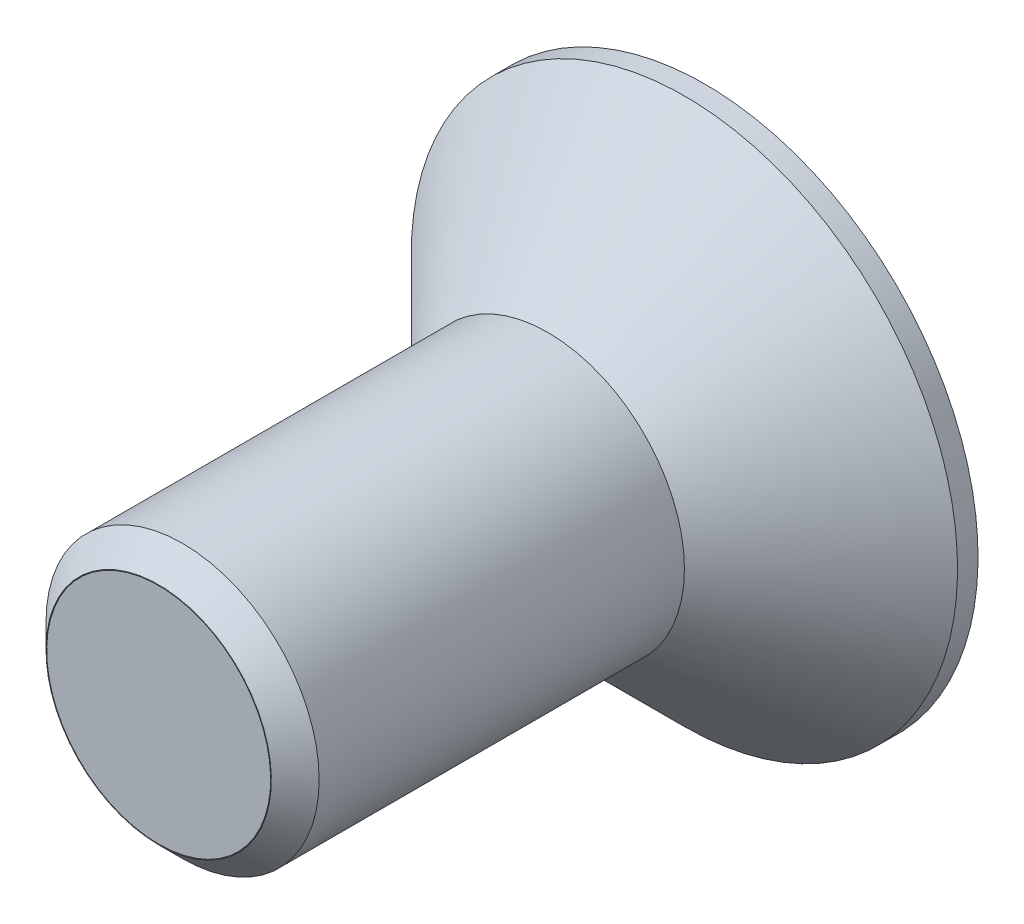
ISO-10303-21;
HEADER;
FILE_DESCRIPTION(('STEP AP214'),'2;1');
FILE_NAME('part.step','',(''),(''),'','','');
FILE_SCHEMA(('AUTOMOTIVE_DESIGN { 1 0 10303 214 1 1 1 1 }'));
ENDSEC;
DATA;
#1=APPLICATION_CONTEXT('core data for automotive mechanical design processes');
#2=APPLICATION_PROTOCOL_DEFINITION('international standard','automotive_design',2000,#1);
#3=PRODUCT_CONTEXT('',#1,'mechanical');
#4=PRODUCT('Part','Part','',(#3));
#5=PRODUCT_RELATED_PRODUCT_CATEGORY('part','',(#4));
#6=PRODUCT_DEFINITION_FORMATION('','',#4);
#7=PRODUCT_DEFINITION_CONTEXT('part definition',#1,'design');
#8=PRODUCT_DEFINITION('design','',#6,#7);
#9=PRODUCT_DEFINITION_SHAPE('','',#8);
#10=(LENGTH_UNIT() NAMED_UNIT(*) SI_UNIT(.MILLI.,.METRE.));
#11=(NAMED_UNIT(*) PLANE_ANGLE_UNIT() SI_UNIT($,.RADIAN.));
#12=(NAMED_UNIT(*) SI_UNIT($,.STERADIAN.) SOLID_ANGLE_UNIT());
#13=UNCERTAINTY_MEASURE_WITH_UNIT(LENGTH_MEASURE(1.E-05),#10,'distance_accuracy_value','');
#14=(GEOMETRIC_REPRESENTATION_CONTEXT(3) GLOBAL_UNCERTAINTY_ASSIGNED_CONTEXT((#13)) GLOBAL_UNIT_ASSIGNED_CONTEXT((#10,
#11,#12)) REPRESENTATION_CONTEXT('',''));
#15=CARTESIAN_POINT('',(0.,0.,0.));
#16=DIRECTION('',(0.,0.,1.));
#17=DIRECTION('',(1.,0.,0.));
#18=AXIS2_PLACEMENT_3D('',#15,#16,#17);
#19=CARTESIAN_POINT('',(0.,1.975,0.0500000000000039));
#20=DIRECTION('',(0.,0.,-1.));
#21=DIRECTION('',(0.,1.,0.));
#22=AXIS2_PLACEMENT_3D('',#19,#20,#21);
#23=PLANE('',#22);
#24=CARTESIAN_POINT('',(-0.912213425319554,1.58,0.050000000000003));
#25=DIRECTION('',(0.,0.,-1.));
#26=DIRECTION('',(0.,1.,0.));
#27=AXIS2_PLACEMENT_3D('',#24,#25,#26);
#28=CIRCLE('',#27,0.51721342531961);
#29=CARTESIAN_POINT('',(-1.17082013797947,1.13208003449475,0.050000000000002));
#30=VERTEX_POINT('',#29);
#31=CARTESIAN_POINT('',(-0.395,1.58,0.0500000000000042));
#32=VERTEX_POINT('',#31);
#33=EDGE_CURVE('E280',#30,#32,#28,.F.);
#34=ORIENTED_EDGE('',*,*,#33,.F.);
#35=CARTESIAN_POINT('',(-1.36832013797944,0.789999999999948,0.050000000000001));
#36=DIRECTION('',(0.,0.,-1.));
#37=DIRECTION('',(0.,1.,0.));
#38=AXIS2_PLACEMENT_3D('',#35,#36,#37);
#39=CIRCLE('',#38,0.394999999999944);
#40=CARTESIAN_POINT('',(-1.71040017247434,0.987499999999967,0.049999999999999));
#41=VERTEX_POINT('',#40);
#42=EDGE_CURVE('E232',#41,#30,#39,.T.);
#43=ORIENTED_EDGE('',*,*,#42,.F.);
#44=CARTESIAN_POINT('',(0.,0.,0.0499999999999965));
#45=DIRECTION('',(0.,0.,1.));
#46=DIRECTION('',(0.,-1.,0.));
#47=AXIS2_PLACEMENT_3D('',#44,#45,#46);
#48=CIRCLE('',#47,1.975);
#49=CARTESIAN_POINT('',(0.,1.975,0.0500000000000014));
#50=VERTEX_POINT('',#49);
#51=EDGE_CURVE('E250',#50,#41,#48,.T.);
#52=ORIENTED_EDGE('',*,*,#51,.F.);
#53=CARTESIAN_POINT('',(0.,1.58,0.050000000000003));
#54=DIRECTION('',(0.,0.,-1.));
#55=DIRECTION('',(0.,1.,0.));
#56=AXIS2_PLACEMENT_3D('',#53,#54,#55);
#57=CIRCLE('',#56,0.394999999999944);
#58=EDGE_CURVE('E243',#32,#50,#57,.T.);
#59=ORIENTED_EDGE('',*,*,#58,.F.);
#60=EDGE_LOOP('',(#34,#43,#52,#59));
#61=FACE_BOUND('',#60,.T.);
#62=ADVANCED_FACE('F36',(#61),#23,.T.);
#63=CARTESIAN_POINT('',(-1.56582013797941,0.447919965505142,0.0500000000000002));
#64=VERTEX_POINT('',#63);
#65=EDGE_CURVE('E157',#64,#41,#39,.T.);
#66=ORIENTED_EDGE('',*,*,#65,.F.);
#67=CARTESIAN_POINT('',(-1.82442685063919,0.,0.0499999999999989));
#68=DIRECTION('',(0.,0.,-1.));
#69=DIRECTION('',(0.,1.,0.));
#70=AXIS2_PLACEMENT_3D('',#67,#68,#69);
#71=CIRCLE('',#70,0.51721342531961);
#72=CARTESIAN_POINT('',(-1.56582013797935,-0.44791996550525,0.049999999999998));
#73=VERTEX_POINT('',#72);
#74=EDGE_CURVE('E11',#73,#64,#71,.F.);
#75=ORIENTED_EDGE('',*,*,#74,.F.);
#76=CARTESIAN_POINT('',(-1.36832013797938,-0.790000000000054,0.049999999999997));
#77=DIRECTION('',(0.,0.,-1.));
#78=DIRECTION('',(0.,1.,0.));
#79=AXIS2_PLACEMENT_3D('',#76,#77,#78);
#80=CIRCLE('',#79,0.394999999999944);
#81=CARTESIAN_POINT('',(-1.71040017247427,-0.987500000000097,0.049999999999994));
#82=VERTEX_POINT('',#81);
#83=EDGE_CURVE('E229',#82,#73,#80,.T.);
#84=ORIENTED_EDGE('',*,*,#83,.F.);
#85=EDGE_CURVE('E253',#41,#82,#48,.T.);
#86=ORIENTED_EDGE('',*,*,#85,.F.);
#87=EDGE_LOOP('',(#66,#75,#84,#86));
#88=FACE_BOUND('',#87,.T.);
#89=ADVANCED_FACE('F311',(#88),#23,.T.);
#90=CARTESIAN_POINT('',(-1.17082013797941,-1.13208003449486,0.0499999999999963));
#91=VERTEX_POINT('',#90);
#92=EDGE_CURVE('E231',#91,#82,#80,.T.);
#93=ORIENTED_EDGE('',*,*,#92,.F.);
#94=CARTESIAN_POINT('',(-0.912213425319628,-1.57999999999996,0.049999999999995));
#95=DIRECTION('',(0.,0.,-1.));
#96=DIRECTION('',(0.,1.,0.));
#97=AXIS2_PLACEMENT_3D('',#94,#95,#96);
#98=CIRCLE('',#97,0.51721342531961);
#99=CARTESIAN_POINT('',(-0.394999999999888,-1.58,0.049999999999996));
#100=VERTEX_POINT('',#99);
#101=EDGE_CURVE('E44',#100,#91,#98,.F.);
#102=ORIENTED_EDGE('',*,*,#101,.F.);
#103=CARTESIAN_POINT('',(0.,-1.58,0.049999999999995));
#104=DIRECTION('',(0.,0.,-1.));
#105=DIRECTION('',(0.,1.,0.));
#106=AXIS2_PLACEMENT_3D('',#103,#104,#105);
#107=CIRCLE('',#106,0.394999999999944);
#108=CARTESIAN_POINT('',(0.,-1.975,0.0499999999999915));
#109=VERTEX_POINT('',#108);
#110=EDGE_CURVE('E226',#109,#100,#107,.T.);
#111=ORIENTED_EDGE('',*,*,#110,.F.);
#112=EDGE_CURVE('E301',#82,#109,#48,.T.);
#113=ORIENTED_EDGE('',*,*,#112,.F.);
#114=EDGE_LOOP('',(#93,#102,#111,#113));
#115=FACE_BOUND('',#114,.T.);
#116=ADVANCED_FACE('F299',(#115),#23,.T.);
#117=CARTESIAN_POINT('',(0.395,-1.58,0.0499999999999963));
#118=VERTEX_POINT('',#117);
#119=EDGE_CURVE('E228',#118,#109,#107,.T.);
#120=ORIENTED_EDGE('',*,*,#119,.F.);
#121=CARTESIAN_POINT('',(0.912213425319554,-1.58,0.049999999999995));
#122=DIRECTION('',(0.,0.,-1.));
#123=DIRECTION('',(0.,1.,0.));
#124=AXIS2_PLACEMENT_3D('',#121,#122,#123);
#125=CIRCLE('',#124,0.51721342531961);
#126=CARTESIAN_POINT('',(1.17082013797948,-1.13208003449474,0.049999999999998));
#127=VERTEX_POINT('',#126);
#128=EDGE_CURVE('E285',#127,#118,#125,.F.);
#129=ORIENTED_EDGE('',*,*,#128,.F.);
#130=CARTESIAN_POINT('',(1.36832013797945,-0.789999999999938,0.049999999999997));
#131=DIRECTION('',(0.,0.,-1.));
#132=DIRECTION('',(0.,1.,0.));
#133=AXIS2_PLACEMENT_3D('',#130,#131,#132);
#134=CIRCLE('',#133,0.394999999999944);
#135=CARTESIAN_POINT('',(1.71040017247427,-0.987499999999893,0.049999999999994));
#136=VERTEX_POINT('',#135);
#137=EDGE_CURVE('E223',#136,#127,#134,.T.);
#138=ORIENTED_EDGE('',*,*,#137,.F.);
#139=EDGE_CURVE('E305',#109,#136,#48,.T.);
#140=ORIENTED_EDGE('',*,*,#139,.F.);
#141=EDGE_LOOP('',(#120,#129,#138,#140));
#142=FACE_BOUND('',#141,.T.);
#143=ADVANCED_FACE('F347',(#142),#23,.T.);
#144=CARTESIAN_POINT('',(1.56582013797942,-0.447919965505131,0.0500000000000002));
#145=VERTEX_POINT('',#144);
#146=EDGE_CURVE('E225',#145,#136,#134,.T.);
#147=ORIENTED_EDGE('',*,*,#146,.F.);
#148=CARTESIAN_POINT('',(1.82442685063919,0.,0.0499999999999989));
#149=DIRECTION('',(0.,0.,-1.));
#150=DIRECTION('',(0.,1.,0.));
#151=AXIS2_PLACEMENT_3D('',#148,#149,#150);
#152=CIRCLE('',#151,0.51721342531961);
#153=CARTESIAN_POINT('',(1.56582013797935,0.447919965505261,0.050000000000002));
#154=VERTEX_POINT('',#153);
#155=EDGE_CURVE('E283',#154,#145,#152,.F.);
#156=ORIENTED_EDGE('',*,*,#155,.F.);
#157=CARTESIAN_POINT('',(1.36832013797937,0.790000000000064,0.050000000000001));
#158=DIRECTION('',(0.,0.,-1.));
#159=DIRECTION('',(0.,1.,0.));
#160=AXIS2_PLACEMENT_3D('',#157,#158,#159);
#161=CIRCLE('',#160,0.394999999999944);
#162=CARTESIAN_POINT('',(1.71040017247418,0.98750000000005,0.049999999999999));
#163=VERTEX_POINT('',#162);
#164=EDGE_CURVE('E218',#163,#154,#161,.T.);
#165=ORIENTED_EDGE('',*,*,#164,.F.);
#166=EDGE_CURVE('E332',#136,#163,#48,.T.);
#167=ORIENTED_EDGE('',*,*,#166,.F.);
#168=EDGE_LOOP('',(#147,#156,#165,#167));
#169=FACE_BOUND('',#168,.T.);
#170=ADVANCED_FACE('F331',(#169),#23,.T.);
#171=CARTESIAN_POINT('',(0.,0.,0.0500000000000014));
#172=DIRECTION('',(0.,0.,1.));
#173=DIRECTION('',(0.,-1.,0.));
#174=AXIS2_PLACEMENT_3D('',#171,#172,#173);
#175=CYLINDRICAL_SURFACE('',#174,4.);
#176=CARTESIAN_POINT('',(0.,0.,0.));
#177=DIRECTION('',(0.,0.,1.));
#178=DIRECTION('',(0.,-1.,0.));
#179=AXIS2_PLACEMENT_3D('',#176,#177,#178);
#180=CIRCLE('',#179,4.);
#181=CARTESIAN_POINT('',(0.,-4.,0.));
#182=VERTEX_POINT('',#181);
#183=EDGE_CURVE('E244',#182,#182,#180,.T.);
#184=ORIENTED_EDGE('',*,*,#183,.T.);
#185=EDGE_LOOP('',(#184));
#186=FACE_BOUND('',#185,.T.);
#187=CARTESIAN_POINT('',(0.,0.,0.299999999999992));
#188=DIRECTION('',(0.,0.,1.));
#189=DIRECTION('',(0.,-1.,0.));
#190=AXIS2_PLACEMENT_3D('',#187,#188,#189);
#191=CIRCLE('',#190,4.);
#192=CARTESIAN_POINT('',(0.,-4.,0.299999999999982));
#193=VERTEX_POINT('',#192);
#194=EDGE_CURVE('E277',#193,#193,#191,.T.);
#195=ORIENTED_EDGE('',*,*,#194,.F.);
#196=EDGE_LOOP('',(#195));
#197=FACE_BOUND('',#196,.T.);
#198=ADVANCED_FACE('F38',(#186,#197),#175,.T.);
#199=CARTESIAN_POINT('',(0.,0.,2.29999999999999));
#200=DIRECTION('',(0.,0.,-1.));
#201=DIRECTION('',(0.,1.,0.));
#202=AXIS2_PLACEMENT_3D('',#199,#200,#201);
#203=CONICAL_SURFACE('',#202,2.00000000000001,0.785398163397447);
#204=ORIENTED_EDGE('',*,*,#194,.T.);
#205=EDGE_LOOP('',(#204));
#206=FACE_BOUND('',#205,.T.);
#207=CARTESIAN_POINT('',(0.,0.,2.29999999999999));
#208=DIRECTION('',(0.,0.,1.));
#209=DIRECTION('',(0.,-1.,0.));
#210=AXIS2_PLACEMENT_3D('',#207,#208,#209);
#211=CIRCLE('',#210,2.00000000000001);
#212=CARTESIAN_POINT('',(0.,-2.00000000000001,2.29999999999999));
#213=VERTEX_POINT('',#212);
#214=EDGE_CURVE('E274',#213,#213,#211,.T.);
#215=ORIENTED_EDGE('',*,*,#214,.F.);
#216=EDGE_LOOP('',(#215));
#217=FACE_BOUND('',#216,.T.);
#218=ADVANCED_FACE('F381',(#206,#217),#203,.T.);
#219=CARTESIAN_POINT('',(0.,0.,0.0500000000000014));
#220=DIRECTION('',(0.,0.,1.));
#221=DIRECTION('',(0.,-1.,0.));
#222=AXIS2_PLACEMENT_3D('',#219,#220,#221);
#223=CYLINDRICAL_SURFACE('',#222,2.00000000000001);
#224=ORIENTED_EDGE('',*,*,#214,.T.);
#225=EDGE_LOOP('',(#224));
#226=FACE_BOUND('',#225,.T.);
#227=CARTESIAN_POINT('',(0.,0.,7.64999999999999));
#228=DIRECTION('',(0.,0.,1.));
#229=DIRECTION('',(0.,-1.,0.));
#230=AXIS2_PLACEMENT_3D('',#227,#228,#229);
#231=CIRCLE('',#230,2.00000000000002);
#232=CARTESIAN_POINT('',(0.,-2.00000000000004,7.64999999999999));
#233=VERTEX_POINT('',#232);
#234=EDGE_CURVE('E271',#233,#233,#231,.T.);
#235=ORIENTED_EDGE('',*,*,#234,.F.);
#236=EDGE_LOOP('',(#235));
#237=FACE_BOUND('',#236,.T.);
#238=ADVANCED_FACE('F475',(#226,#237),#223,.T.);
#239=CARTESIAN_POINT('',(0.,0.,8.));
#240=DIRECTION('',(0.,0.,-1.));
#241=DIRECTION('',(0.,1.,0.));
#242=AXIS2_PLACEMENT_3D('',#239,#240,#241);
#243=CONICAL_SURFACE('',#242,1.65000000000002,0.785398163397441);
#244=ORIENTED_EDGE('',*,*,#234,.T.);
#245=EDGE_LOOP('',(#244));
#246=FACE_BOUND('',#245,.T.);
#247=CARTESIAN_POINT('',(0.,0.,8.));
#248=DIRECTION('',(0.,0.,1.));
#249=DIRECTION('',(0.,-1.,0.));
#250=AXIS2_PLACEMENT_3D('',#247,#248,#249);
#251=CIRCLE('',#250,1.65000000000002);
#252=CARTESIAN_POINT('',(0.,-1.65000000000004,7.99999999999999));
#253=VERTEX_POINT('',#252);
#254=EDGE_CURVE('E268',#253,#253,#251,.T.);
#255=ORIENTED_EDGE('',*,*,#254,.F.);
#256=EDGE_LOOP('',(#255));
#257=FACE_BOUND('',#256,.T.);
#258=ADVANCED_FACE('F465',(#246,#257),#243,.T.);
#259=CARTESIAN_POINT('',(0.,0.,0.0500000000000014));
#260=DIRECTION('',(0.,0.,1.));
#261=DIRECTION('',(0.,-1.,0.));
#262=AXIS2_PLACEMENT_3D('',#259,#260,#261);
#263=CYLINDRICAL_SURFACE('',#262,1.65000000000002);
#264=ORIENTED_EDGE('',*,*,#254,.T.);
#265=EDGE_LOOP('',(#264));
#266=FACE_BOUND('',#265,.T.);
#267=CARTESIAN_POINT('',(0.,0.,4.74));
#268=DIRECTION('',(0.,0.,1.));
#269=DIRECTION('',(0.,-1.,0.));
#270=AXIS2_PLACEMENT_3D('',#267,#268,#269);
#271=CIRCLE('',#270,1.65000000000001);
#272=CARTESIAN_POINT('',(0.,-1.65000000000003,4.73999999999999));
#273=VERTEX_POINT('',#272);
#274=EDGE_CURVE('E265',#273,#273,#271,.T.);
#275=ORIENTED_EDGE('',*,*,#274,.F.);
#276=EDGE_LOOP('',(#275));
#277=FACE_BOUND('',#276,.T.);
#278=ADVANCED_FACE('F455',(#266,#277),#263,.F.);
#279=CARTESIAN_POINT('',(0.,0.,4.4));
#280=DIRECTION('',(0.,0.,-1.));
#281=DIRECTION('',(0.,1.,0.));
#282=AXIS2_PLACEMENT_3D('',#279,#280,#281);
#283=CONICAL_SURFACE('',#282,1.99000000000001,0.785398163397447);
#284=ORIENTED_EDGE('',*,*,#274,.T.);
#285=EDGE_LOOP('',(#284));
#286=FACE_BOUND('',#285,.T.);
#287=CARTESIAN_POINT('',(0.,0.,4.4));
#288=DIRECTION('',(0.,0.,1.));
#289=DIRECTION('',(0.,-1.,0.));
#290=AXIS2_PLACEMENT_3D('',#287,#288,#289);
#291=CIRCLE('',#290,1.99000000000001);
#292=CARTESIAN_POINT('',(0.,-1.99000000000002,4.39999999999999));
#293=VERTEX_POINT('',#292);
#294=EDGE_CURVE('E262',#293,#293,#291,.T.);
#295=ORIENTED_EDGE('',*,*,#294,.F.);
#296=EDGE_LOOP('',(#295));
#297=FACE_BOUND('',#296,.T.);
#298=ADVANCED_FACE('F445',(#286,#297),#283,.F.);
#299=CARTESIAN_POINT('',(0.,0.,0.0500000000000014));
#300=DIRECTION('',(0.,0.,1.));
#301=DIRECTION('',(0.,-1.,0.));
#302=AXIS2_PLACEMENT_3D('',#299,#300,#301);
#303=CYLINDRICAL_SURFACE('',#302,1.99000000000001);
#304=ORIENTED_EDGE('',*,*,#294,.T.);
#305=EDGE_LOOP('',(#304));
#306=FACE_BOUND('',#305,.T.);
#307=CARTESIAN_POINT('',(0.,0.,4.38999999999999));
#308=DIRECTION('',(0.,0.,1.));
#309=DIRECTION('',(0.,-1.,0.));
#310=AXIS2_PLACEMENT_3D('',#307,#308,#309);
#311=CIRCLE('',#310,1.99000000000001);
#312=CARTESIAN_POINT('',(0.,-1.99000000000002,4.38999999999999));
#313=VERTEX_POINT('',#312);
#314=EDGE_CURVE('E259',#313,#313,#311,.T.);
#315=ORIENTED_EDGE('',*,*,#314,.F.);
#316=EDGE_LOOP('',(#315));
#317=FACE_BOUND('',#316,.T.);
#318=ADVANCED_FACE('F435',(#306,#317),#303,.F.);
#319=CARTESIAN_POINT('',(0.,0.,4.73999999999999));
#320=DIRECTION('',(0.,0.,-1.));
#321=DIRECTION('',(0.,1.,0.));
#322=AXIS2_PLACEMENT_3D('',#319,#320,#321);
#323=CONICAL_SURFACE('',#322,1.64000000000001,0.785398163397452);
#324=ORIENTED_EDGE('',*,*,#314,.T.);
#325=EDGE_LOOP('',(#324));
#326=FACE_BOUND('',#325,.T.);
#327=CARTESIAN_POINT('',(0.,0.,4.73999999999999));
#328=DIRECTION('',(0.,0.,1.));
#329=DIRECTION('',(0.,-1.,0.));
#330=AXIS2_PLACEMENT_3D('',#327,#328,#329);
#331=CIRCLE('',#330,1.64000000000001);
#332=CARTESIAN_POINT('',(0.,-1.64000000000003,4.73999999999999));
#333=VERTEX_POINT('',#332);
#334=EDGE_CURVE('E256',#333,#333,#331,.T.);
#335=ORIENTED_EDGE('',*,*,#334,.F.);
#336=EDGE_LOOP('',(#335));
#337=FACE_BOUND('',#336,.T.);
#338=ADVANCED_FACE('F425',(#326,#337),#323,.T.);
#339=CARTESIAN_POINT('',(0.,0.,0.0500000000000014));
#340=DIRECTION('',(0.,0.,1.));
#341=DIRECTION('',(0.,-1.,0.));
#342=AXIS2_PLACEMENT_3D('',#339,#340,#341);
#343=CYLINDRICAL_SURFACE('',#342,1.64000000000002);
#344=ORIENTED_EDGE('',*,*,#334,.T.);
#345=EDGE_LOOP('',(#344));
#346=FACE_BOUND('',#345,.T.);
#347=CARTESIAN_POINT('',(0.,0.,8.));
#348=DIRECTION('',(0.,0.,1.));
#349=DIRECTION('',(0.,-1.,0.));
#350=AXIS2_PLACEMENT_3D('',#347,#348,#349);
#351=CIRCLE('',#350,1.64000000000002);
#352=CARTESIAN_POINT('',(0.,-1.64000000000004,7.99999999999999));
#353=VERTEX_POINT('',#352);
#354=EDGE_CURVE('E252',#353,#353,#351,.T.);
#355=ORIENTED_EDGE('',*,*,#354,.F.);
#356=EDGE_LOOP('',(#355));
#357=FACE_BOUND('',#356,.T.);
#358=ADVANCED_FACE('F374',(#346,#357),#343,.T.);
#359=CARTESIAN_POINT('',(0.,1.64,8.));
#360=DIRECTION('',(0.,0.,1.));
#361=DIRECTION('',(0.,-1.,0.));
#362=AXIS2_PLACEMENT_3D('',#359,#360,#361);
#363=PLANE('',#362);
#364=ORIENTED_EDGE('',*,*,#354,.T.);
#365=EDGE_LOOP('',(#364));
#366=FACE_BOUND('',#365,.T.);
#367=ADVANCED_FACE('F367',(#366),#363,.T.);
#368=CARTESIAN_POINT('',(1.1708201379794,1.13208003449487,0.0500000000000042));
#369=VERTEX_POINT('',#368);
#370=EDGE_CURVE('E222',#369,#163,#161,.T.);
#371=ORIENTED_EDGE('',*,*,#370,.F.);
#372=CARTESIAN_POINT('',(0.912213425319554,1.58,0.050000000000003));
#373=DIRECTION('',(0.,0.,-1.));
#374=DIRECTION('',(0.,1.,0.));
#375=AXIS2_PLACEMENT_3D('',#372,#373,#374);
#376=CIRCLE('',#375,0.51721342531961);
#377=CARTESIAN_POINT('',(0.394999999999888,1.58,0.0500000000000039));
#378=VERTEX_POINT('',#377);
#379=EDGE_CURVE('E163',#378,#369,#376,.F.);
#380=ORIENTED_EDGE('',*,*,#379,.F.);
#381=EDGE_CURVE('E58',#50,#378,#57,.T.);
#382=ORIENTED_EDGE('',*,*,#381,.F.);
#383=EDGE_CURVE('E51',#163,#50,#48,.T.);
#384=ORIENTED_EDGE('',*,*,#383,.F.);
#385=EDGE_LOOP('',(#371,#380,#382,#384));
#386=FACE_BOUND('',#385,.T.);
#387=ADVANCED_FACE('F325',(#386),#23,.T.);
#388=CARTESIAN_POINT('',(0.,0.,0.0500000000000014));
#389=DIRECTION('',(0.,0.,1.));
#390=DIRECTION('',(0.,-1.,0.));
#391=AXIS2_PLACEMENT_3D('',#388,#389,#390);
#392=CYLINDRICAL_SURFACE('',#391,1.975);
#393=CARTESIAN_POINT('',(0.,0.,0.));
#394=DIRECTION('',(0.,0.,1.));
#395=DIRECTION('',(0.,-1.,0.));
#396=AXIS2_PLACEMENT_3D('',#393,#394,#395);
#397=CIRCLE('',#396,1.975);
#398=CARTESIAN_POINT('',(0.,-1.975,0.));
#399=VERTEX_POINT('',#398);
#400=EDGE_CURVE('E247',#399,#399,#397,.T.);
#401=ORIENTED_EDGE('',*,*,#400,.F.);
#402=EDGE_LOOP('',(#401));
#403=FACE_BOUND('',#402,.T.);
#404=ORIENTED_EDGE('',*,*,#51,.T.);
#405=ORIENTED_EDGE('',*,*,#85,.T.);
#406=ORIENTED_EDGE('',*,*,#112,.T.);
#407=ORIENTED_EDGE('',*,*,#139,.T.);
#408=ORIENTED_EDGE('',*,*,#166,.T.);
#409=ORIENTED_EDGE('',*,*,#383,.T.);
#410=EDGE_LOOP('',(#404,#405,#406,#407,#408,#409));
#411=FACE_BOUND('',#410,.T.);
#412=ADVANCED_FACE('F307',(#403,#411),#392,.F.);
#413=CARTESIAN_POINT('',(0.,1.975,0.));
#414=DIRECTION('',(0.,0.,-1.));
#415=DIRECTION('',(0.,1.,0.));
#416=AXIS2_PLACEMENT_3D('',#413,#414,#415);
#417=PLANE('',#416);
#418=ORIENTED_EDGE('',*,*,#400,.T.);
#419=EDGE_LOOP('',(#418));
#420=FACE_BOUND('',#419,.T.);
#421=ORIENTED_EDGE('',*,*,#183,.F.);
#422=EDGE_LOOP('',(#421));
#423=FACE_BOUND('',#422,.T.);
#424=ADVANCED_FACE('F372',(#420,#423),#417,.T.);
#425=CARTESIAN_POINT('',(0.912213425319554,1.58,0.95));
#426=DIRECTION('',(0.,0.,-1.));
#427=DIRECTION('',(0.,1.,0.));
#428=AXIS2_PLACEMENT_3D('',#425,#426,#427);
#429=CYLINDRICAL_SURFACE('',#428,0.51721342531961);
#430=ORIENTED_EDGE('',*,*,#379,.T.);
#431=DIRECTION('',(0.,0.,-1.));
#432=VECTOR('',#431,1.);
#433=CARTESIAN_POINT('',(1.1708201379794,1.13208003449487,0.95));
#434=LINE('',#433,#432);
#435=CARTESIAN_POINT('',(1.1708201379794,1.13208003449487,0.95));
#436=VERTEX_POINT('',#435);
#437=EDGE_CURVE('E160',#436,#369,#434,.T.);
#438=ORIENTED_EDGE('',*,*,#437,.F.);
#439=CARTESIAN_POINT('',(0.912213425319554,1.58,0.95));
#440=DIRECTION('',(0.,0.,1.));
#441=DIRECTION('',(0.,-1.,0.));
#442=AXIS2_PLACEMENT_3D('',#439,#440,#441);
#443=CIRCLE('',#442,0.51721342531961);
#444=CARTESIAN_POINT('',(0.394999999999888,1.58,0.95));
#445=VERTEX_POINT('',#444);
#446=EDGE_CURVE('E145',#445,#436,#443,.T.);
#447=ORIENTED_EDGE('',*,*,#446,.F.);
#448=DIRECTION('',(0.,0.,-1.));
#449=VECTOR('',#448,1.);
#450=CARTESIAN_POINT('',(0.394999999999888,1.58,0.95));
#451=LINE('',#450,#449);
#452=EDGE_CURVE('E238',#445,#378,#451,.T.);
#453=ORIENTED_EDGE('',*,*,#452,.T.);
#454=EDGE_LOOP('',(#430,#438,#447,#453));
#455=FACE_BOUND('',#454,.T.);
#456=ADVANCED_FACE('F161',(#455),#429,.T.);
#457=CARTESIAN_POINT('',(0.,1.58,0.95));
#458=DIRECTION('',(0.,0.,-1.));
#459=DIRECTION('',(0.,1.,0.));
#460=AXIS2_PLACEMENT_3D('',#457,#458,#459);
#461=CYLINDRICAL_SURFACE('',#460,0.394999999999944);
#462=ORIENTED_EDGE('',*,*,#58,.T.);
#463=ORIENTED_EDGE('',*,*,#381,.T.);
#464=ORIENTED_EDGE('',*,*,#452,.F.);
#465=CARTESIAN_POINT('',(0.,1.58,0.95));
#466=DIRECTION('',(0.,0.,-1.));
#467=DIRECTION('',(0.,-1.,0.));
#468=AXIS2_PLACEMENT_3D('',#465,#466,#467);
#469=CIRCLE('',#468,0.394999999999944);
#470=CARTESIAN_POINT('',(-0.395,1.58,0.95));
#471=VERTEX_POINT('',#470);
#472=EDGE_CURVE('E154',#471,#445,#469,.T.);
#473=ORIENTED_EDGE('',*,*,#472,.F.);
#474=DIRECTION('',(0.,0.,-1.));
#475=VECTOR('',#474,1.);
#476=CARTESIAN_POINT('',(-0.395,1.58,0.95));
#477=LINE('',#476,#475);
#478=EDGE_CURVE('E237',#471,#32,#477,.T.);
#479=ORIENTED_EDGE('',*,*,#478,.T.);
#480=EDGE_LOOP('',(#462,#463,#464,#473,#479));
#481=FACE_BOUND('',#480,.T.);
#482=ADVANCED_FACE('F322',(#481),#461,.F.);
#483=CARTESIAN_POINT('',(-0.912213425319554,1.58,0.95));
#484=DIRECTION('',(0.,0.,-1.));
#485=DIRECTION('',(0.,1.,0.));
#486=AXIS2_PLACEMENT_3D('',#483,#484,#485);
#487=CYLINDRICAL_SURFACE('',#486,0.51721342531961);
#488=ORIENTED_EDGE('',*,*,#33,.T.);
#489=ORIENTED_EDGE('',*,*,#478,.F.);
#490=CARTESIAN_POINT('',(-0.912213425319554,1.58,0.95));
#491=DIRECTION('',(0.,0.,1.));
#492=DIRECTION('',(0.,1.,0.));
#493=AXIS2_PLACEMENT_3D('',#490,#491,#492);
#494=CIRCLE('',#493,0.51721342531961);
#495=CARTESIAN_POINT('',(-1.17082013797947,1.13208003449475,0.95));
#496=VERTEX_POINT('',#495);
#497=EDGE_CURVE('E156',#496,#471,#494,.T.);
#498=ORIENTED_EDGE('',*,*,#497,.F.);
#499=DIRECTION('',(0.,0.,-1.));
#500=VECTOR('',#499,1.);
#501=CARTESIAN_POINT('',(-1.17082013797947,1.13208003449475,0.95));
#502=LINE('',#501,#500);
#503=EDGE_CURVE('E215',#496,#30,#502,.T.);
#504=ORIENTED_EDGE('',*,*,#503,.T.);
#505=EDGE_LOOP('',(#488,#489,#498,#504));
#506=FACE_BOUND('',#505,.T.);
#507=ADVANCED_FACE('F321',(#506),#487,.T.);
#508=CARTESIAN_POINT('',(0.912213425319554,1.58,0.95));
#509=DIRECTION('',(0.,0.,1.));
#510=DIRECTION('',(0.,-1.,0.));
#511=AXIS2_PLACEMENT_3D('',#508,#509,#510);
#512=PLANE('',#511);
#513=CARTESIAN_POINT('',(-1.36832013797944,0.789999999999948,0.95));
#514=DIRECTION('',(0.,0.,-1.));
#515=DIRECTION('',(0.86602540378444,-0.499999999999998,0.));
#516=AXIS2_PLACEMENT_3D('',#513,#514,#515);
#517=CIRCLE('',#516,0.394999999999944);
#518=CARTESIAN_POINT('',(-1.56582013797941,0.447919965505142,0.95));
#519=VERTEX_POINT('',#518);
#520=EDGE_CURVE('E212',#519,#496,#517,.T.);
#521=ORIENTED_EDGE('',*,*,#520,.T.);
#522=ORIENTED_EDGE('',*,*,#497,.T.);
#523=ORIENTED_EDGE('',*,*,#472,.T.);
#524=ORIENTED_EDGE('',*,*,#446,.T.);
#525=CARTESIAN_POINT('',(1.36832013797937,0.790000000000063,0.95));
#526=DIRECTION('',(0.,0.,-1.));
#527=DIRECTION('',(-0.866025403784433,-0.50000000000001,0.));
#528=AXIS2_PLACEMENT_3D('',#525,#526,#527);
#529=CIRCLE('',#528,0.394999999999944);
#530=CARTESIAN_POINT('',(1.56582013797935,0.447919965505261,0.95));
#531=VERTEX_POINT('',#530);
#532=EDGE_CURVE('E151',#436,#531,#529,.T.);
#533=ORIENTED_EDGE('',*,*,#532,.T.);
#534=CARTESIAN_POINT('',(1.82442685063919,0.,0.95));
#535=DIRECTION('',(0.,0.,1.));
#536=DIRECTION('',(0.866025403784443,-0.499999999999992,0.));
#537=AXIS2_PLACEMENT_3D('',#534,#535,#536);
#538=CIRCLE('',#537,0.51721342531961);
#539=CARTESIAN_POINT('',(1.56582013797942,-0.447919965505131,0.95));
#540=VERTEX_POINT('',#539);
#541=EDGE_CURVE('E173',#531,#540,#538,.T.);
#542=ORIENTED_EDGE('',*,*,#541,.T.);
#543=CARTESIAN_POINT('',(1.36832013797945,-0.789999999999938,0.95));
#544=DIRECTION('',(0.,0.,-1.));
#545=DIRECTION('',(-0.866025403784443,0.499999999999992,0.));
#546=AXIS2_PLACEMENT_3D('',#543,#544,#545);
#547=CIRCLE('',#546,0.394999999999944);
#548=CARTESIAN_POINT('',(1.17082013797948,-1.13208003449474,0.95));
#549=VERTEX_POINT('',#548);
#550=EDGE_CURVE('E176',#540,#549,#547,.T.);
#551=ORIENTED_EDGE('',*,*,#550,.T.);
#552=CARTESIAN_POINT('',(0.912213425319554,-1.58,0.95));
#553=DIRECTION('',(0.,0.,1.));
#554=DIRECTION('',(0.,-1.,0.));
#555=AXIS2_PLACEMENT_3D('',#552,#553,#554);
#556=CIRCLE('',#555,0.51721342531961);
#557=CARTESIAN_POINT('',(0.395,-1.58,0.95));
#558=VERTEX_POINT('',#557);
#559=EDGE_CURVE('E183',#549,#558,#556,.T.);
#560=ORIENTED_EDGE('',*,*,#559,.T.);
#561=CARTESIAN_POINT('',(0.,-1.58,0.95));
#562=DIRECTION('',(0.,0.,-1.));
#563=DIRECTION('',(0.,1.,0.));
#564=AXIS2_PLACEMENT_3D('',#561,#562,#563);
#565=CIRCLE('',#564,0.394999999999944);
#566=CARTESIAN_POINT('',(-0.394999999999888,-1.58,0.95));
#567=VERTEX_POINT('',#566);
#568=EDGE_CURVE('E188',#558,#567,#565,.T.);
#569=ORIENTED_EDGE('',*,*,#568,.T.);
#570=CARTESIAN_POINT('',(-0.912213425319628,-1.57999999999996,0.95));
#571=DIRECTION('',(0.,0.,1.));
#572=DIRECTION('',(-0.866025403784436,-0.500000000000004,0.));
#573=AXIS2_PLACEMENT_3D('',#570,#571,#572);
#574=CIRCLE('',#573,0.51721342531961);
#575=CARTESIAN_POINT('',(-1.17082013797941,-1.13208003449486,0.95));
#576=VERTEX_POINT('',#575);
#577=EDGE_CURVE('E195',#567,#576,#574,.T.);
#578=ORIENTED_EDGE('',*,*,#577,.T.);
#579=CARTESIAN_POINT('',(-1.36832013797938,-0.790000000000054,0.95));
#580=DIRECTION('',(0.,0.,-1.));
#581=DIRECTION('',(0.866025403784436,0.500000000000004,0.));
#582=AXIS2_PLACEMENT_3D('',#579,#580,#581);
#583=CIRCLE('',#582,0.394999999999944);
#584=CARTESIAN_POINT('',(-1.56582013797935,-0.44791996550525,0.95));
#585=VERTEX_POINT('',#584);
#586=EDGE_CURVE('E200',#576,#585,#583,.T.);
#587=ORIENTED_EDGE('',*,*,#586,.T.);
#588=CARTESIAN_POINT('',(-1.82442685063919,0.,0.95));
#589=DIRECTION('',(0.,0.,1.));
#590=DIRECTION('',(-0.86602540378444,0.499999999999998,0.));
#591=AXIS2_PLACEMENT_3D('',#588,#589,#590);
#592=CIRCLE('',#591,0.51721342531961);
#593=EDGE_CURVE('E207',#585,#519,#592,.T.);
#594=ORIENTED_EDGE('',*,*,#593,.T.);
#595=EDGE_LOOP('',(#521,#522,#523,#524,#533,#542,#551,#560,#569,#578,#587,#594));
#596=FACE_BOUND('',#595,.T.);
#597=ADVANCED_FACE('F148',(#596),#512,.F.);
#598=CARTESIAN_POINT('',(-1.36832013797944,0.789999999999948,0.95));
#599=DIRECTION('',(0.,0.,-1.));
#600=DIRECTION('',(-1.,0.,0.));
#601=AXIS2_PLACEMENT_3D('',#598,#599,#600);
#602=CYLINDRICAL_SURFACE('',#601,0.394999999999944);
#603=ORIENTED_EDGE('',*,*,#65,.T.);
#604=ORIENTED_EDGE('',*,*,#42,.T.);
#605=ORIENTED_EDGE('',*,*,#503,.F.);
#606=ORIENTED_EDGE('',*,*,#520,.F.);
#607=DIRECTION('',(0.,0.,-1.));
#608=VECTOR('',#607,1.);
#609=CARTESIAN_POINT('',(-1.56582013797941,0.447919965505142,0.95));
#610=LINE('',#609,#608);
#611=EDGE_CURVE('E214',#519,#64,#610,.T.);
#612=ORIENTED_EDGE('',*,*,#611,.T.);
#613=EDGE_LOOP('',(#603,#604,#605,#606,#612));
#614=FACE_BOUND('',#613,.T.);
#615=ADVANCED_FACE('F318',(#614),#602,.F.);
#616=CARTESIAN_POINT('',(-1.82442685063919,0.,0.95));
#617=DIRECTION('',(0.,0.,-1.));
#618=DIRECTION('',(-1.,0.,0.));
#619=AXIS2_PLACEMENT_3D('',#616,#617,#618);
#620=CYLINDRICAL_SURFACE('',#619,0.51721342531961);
#621=ORIENTED_EDGE('',*,*,#74,.T.);
#622=ORIENTED_EDGE('',*,*,#611,.F.);
#623=ORIENTED_EDGE('',*,*,#593,.F.);
#624=DIRECTION('',(0.,0.,-1.));
#625=VECTOR('',#624,1.);
#626=CARTESIAN_POINT('',(-1.56582013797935,-0.44791996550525,0.95));
#627=LINE('',#626,#625);
#628=EDGE_CURVE('E204',#585,#73,#627,.T.);
#629=ORIENTED_EDGE('',*,*,#628,.T.);
#630=EDGE_LOOP('',(#621,#622,#623,#629));
#631=FACE_BOUND('',#630,.T.);
#632=ADVANCED_FACE('F314',(#631),#620,.T.);
#633=CARTESIAN_POINT('',(-1.36832013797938,-0.790000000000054,0.95));
#634=DIRECTION('',(0.,0.,-1.));
#635=DIRECTION('',(-1.,0.,0.));
#636=AXIS2_PLACEMENT_3D('',#633,#634,#635);
#637=CYLINDRICAL_SURFACE('',#636,0.394999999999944);
#638=ORIENTED_EDGE('',*,*,#92,.T.);
#639=ORIENTED_EDGE('',*,*,#83,.T.);
#640=ORIENTED_EDGE('',*,*,#628,.F.);
#641=ORIENTED_EDGE('',*,*,#586,.F.);
#642=DIRECTION('',(0.,0.,-1.));
#643=VECTOR('',#642,1.);
#644=CARTESIAN_POINT('',(-1.17082013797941,-1.13208003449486,0.95));
#645=LINE('',#644,#643);
#646=EDGE_CURVE('E203',#576,#91,#645,.T.);
#647=ORIENTED_EDGE('',*,*,#646,.T.);
#648=EDGE_LOOP('',(#638,#639,#640,#641,#647));
#649=FACE_BOUND('',#648,.T.);
#650=ADVANCED_FACE('F295',(#649),#637,.F.);
#651=CARTESIAN_POINT('',(-0.912213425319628,-1.57999999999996,0.95));
#652=DIRECTION('',(0.,0.,-1.));
#653=DIRECTION('',(-1.,0.,0.));
#654=AXIS2_PLACEMENT_3D('',#651,#652,#653);
#655=CYLINDRICAL_SURFACE('',#654,0.51721342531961);
#656=ORIENTED_EDGE('',*,*,#101,.T.);
#657=ORIENTED_EDGE('',*,*,#646,.F.);
#658=ORIENTED_EDGE('',*,*,#577,.F.);
#659=DIRECTION('',(0.,0.,-1.));
#660=VECTOR('',#659,1.);
#661=CARTESIAN_POINT('',(-0.394999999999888,-1.58,0.95));
#662=LINE('',#661,#660);
#663=EDGE_CURVE('E192',#567,#100,#662,.T.);
#664=ORIENTED_EDGE('',*,*,#663,.T.);
#665=EDGE_LOOP('',(#656,#657,#658,#664));
#666=FACE_BOUND('',#665,.T.);
#667=ADVANCED_FACE('F288',(#666),#655,.T.);
#668=CARTESIAN_POINT('',(0.,-1.58,0.95));
#669=DIRECTION('',(0.,0.,-1.));
#670=DIRECTION('',(0.,1.,0.));
#671=AXIS2_PLACEMENT_3D('',#668,#669,#670);
#672=CYLINDRICAL_SURFACE('',#671,0.394999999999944);
#673=ORIENTED_EDGE('',*,*,#119,.T.);
#674=ORIENTED_EDGE('',*,*,#110,.T.);
#675=ORIENTED_EDGE('',*,*,#663,.F.);
#676=ORIENTED_EDGE('',*,*,#568,.F.);
#677=DIRECTION('',(0.,0.,-1.));
#678=VECTOR('',#677,1.);
#679=CARTESIAN_POINT('',(0.395,-1.58,0.95));
#680=LINE('',#679,#678);
#681=EDGE_CURVE('E191',#558,#118,#680,.T.);
#682=ORIENTED_EDGE('',*,*,#681,.T.);
#683=EDGE_LOOP('',(#673,#674,#675,#676,#682));
#684=FACE_BOUND('',#683,.T.);
#685=ADVANCED_FACE('F343',(#684),#672,.F.);
#686=CARTESIAN_POINT('',(0.912213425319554,-1.58,0.95));
#687=DIRECTION('',(0.,0.,-1.));
#688=DIRECTION('',(0.,1.,0.));
#689=AXIS2_PLACEMENT_3D('',#686,#687,#688);
#690=CYLINDRICAL_SURFACE('',#689,0.51721342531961);
#691=ORIENTED_EDGE('',*,*,#128,.T.);
#692=ORIENTED_EDGE('',*,*,#681,.F.);
#693=ORIENTED_EDGE('',*,*,#559,.F.);
#694=DIRECTION('',(0.,0.,-1.));
#695=VECTOR('',#694,1.);
#696=CARTESIAN_POINT('',(1.17082013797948,-1.13208003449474,0.95));
#697=LINE('',#696,#695);
#698=EDGE_CURVE('E180',#549,#127,#697,.T.);
#699=ORIENTED_EDGE('',*,*,#698,.T.);
#700=EDGE_LOOP('',(#691,#692,#693,#699));
#701=FACE_BOUND('',#700,.T.);
#702=ADVANCED_FACE('F348',(#701),#690,.T.);
#703=CARTESIAN_POINT('',(1.36832013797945,-0.789999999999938,0.95));
#704=DIRECTION('',(0.,0.,-1.));
#705=DIRECTION('',(-1.,0.,0.));
#706=AXIS2_PLACEMENT_3D('',#703,#704,#705);
#707=CYLINDRICAL_SURFACE('',#706,0.394999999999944);
#708=ORIENTED_EDGE('',*,*,#146,.T.);
#709=ORIENTED_EDGE('',*,*,#137,.T.);
#710=ORIENTED_EDGE('',*,*,#698,.F.);
#711=ORIENTED_EDGE('',*,*,#550,.F.);
#712=DIRECTION('',(0.,0.,-1.));
#713=VECTOR('',#712,1.);
#714=CARTESIAN_POINT('',(1.56582013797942,-0.447919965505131,0.95));
#715=LINE('',#714,#713);
#716=EDGE_CURVE('E179',#540,#145,#715,.T.);
#717=ORIENTED_EDGE('',*,*,#716,.T.);
#718=EDGE_LOOP('',(#708,#709,#710,#711,#717));
#719=FACE_BOUND('',#718,.T.);
#720=ADVANCED_FACE('F337',(#719),#707,.F.);
#721=CARTESIAN_POINT('',(1.82442685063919,0.,0.95));
#722=DIRECTION('',(0.,0.,-1.));
#723=DIRECTION('',(-1.,0.,0.));
#724=AXIS2_PLACEMENT_3D('',#721,#722,#723);
#725=CYLINDRICAL_SURFACE('',#724,0.51721342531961);
#726=ORIENTED_EDGE('',*,*,#155,.T.);
#727=ORIENTED_EDGE('',*,*,#716,.F.);
#728=ORIENTED_EDGE('',*,*,#541,.F.);
#729=DIRECTION('',(0.,0.,-1.));
#730=VECTOR('',#729,1.);
#731=CARTESIAN_POINT('',(1.56582013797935,0.447919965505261,0.95));
#732=LINE('',#731,#730);
#733=EDGE_CURVE('E166',#531,#154,#732,.T.);
#734=ORIENTED_EDGE('',*,*,#733,.T.);
#735=EDGE_LOOP('',(#726,#727,#728,#734));
#736=FACE_BOUND('',#735,.T.);
#737=ADVANCED_FACE('F334',(#736),#725,.T.);
#738=CARTESIAN_POINT('',(1.36832013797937,0.790000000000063,0.95));
#739=DIRECTION('',(0.,0.,-1.));
#740=DIRECTION('',(-1.,0.,0.));
#741=AXIS2_PLACEMENT_3D('',#738,#739,#740);
#742=CYLINDRICAL_SURFACE('',#741,0.394999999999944);
#743=ORIENTED_EDGE('',*,*,#370,.T.);
#744=ORIENTED_EDGE('',*,*,#164,.T.);
#745=ORIENTED_EDGE('',*,*,#733,.F.);
#746=ORIENTED_EDGE('',*,*,#532,.F.);
#747=ORIENTED_EDGE('',*,*,#437,.T.);
#748=EDGE_LOOP('',(#743,#744,#745,#746,#747));
#749=FACE_BOUND('',#748,.T.);
#750=ADVANCED_FACE('F169',(#749),#742,.F.);
#751=CLOSED_SHELL('',(#62,#89,#116,#143,#170,#198,#218,#238,#258,#278,#298,#318,#338,#358,#367,
#387,#412,#424,#456,#482,#507,#597,#615,#632,#650,#667,#685,#702,#720,#737,#750));
#752=MANIFOLD_SOLID_BREP('B2',#751);
#753=ADVANCED_BREP_SHAPE_REPRESENTATION('',(#18,#752),#14);
#754=SHAPE_DEFINITION_REPRESENTATION(#9,#753);
ENDSEC;
END-ISO-10303-21;
